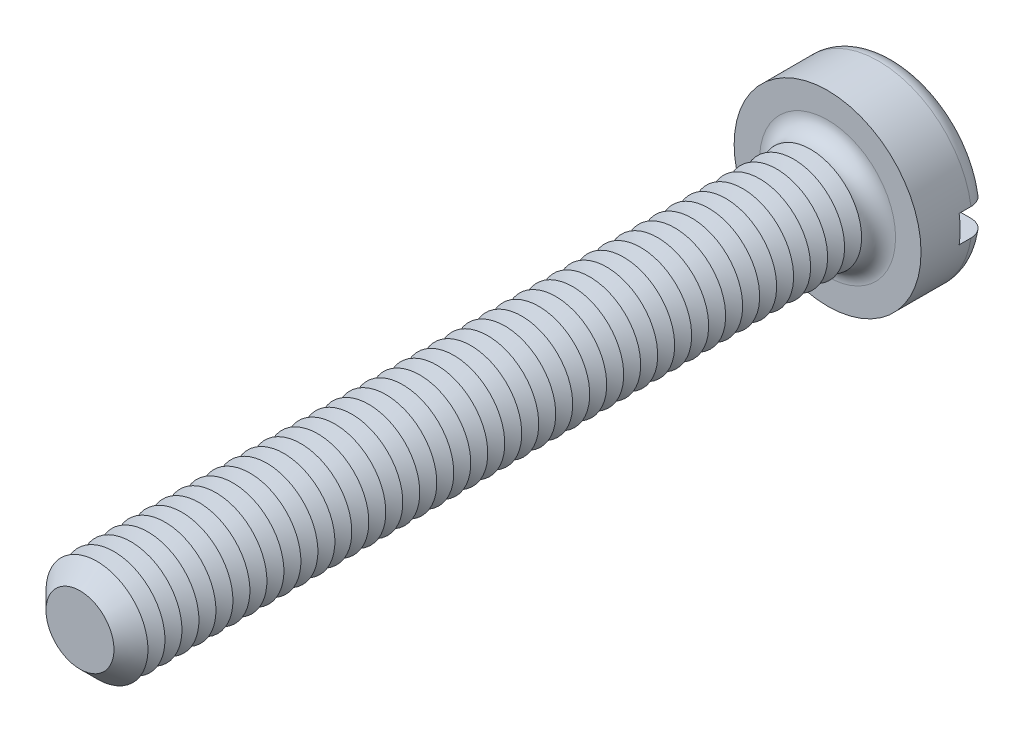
from build123d import *

# Parameters (mm, degrees)
SKETCH3_R           = 2.75
BOSS_EXTRUDE2_DEPTH = 2
SKETCH4_R           = 1.5
BOSS_EXTRUDE3_DEPTH = 22
FILLET1_R           = 0.5
CHAMFER1_SIZE       = 0.5
LPATTERN1_COUNT     = 42
LPATTERN1_PITCH     = 0.5
SKETCH8_W           = 5.5
SKETCH8_H           = 0.8
CUT_EXTRUDE1_DEPTH  = 0.85


with BuildPart() as part:
    # Sketch3 → Boss-Extrude2 (new body)
    with BuildSketch(Plane.XY):
        Circle(SKETCH3_R)
    extrude(amount=-BOSS_EXTRUDE2_DEPTH)

    # Sketch4 → Boss-Extrude3 (add)
    with BuildSketch(Plane.XY):
        Circle(SKETCH4_R)
    extrude(amount=BOSS_EXTRUDE3_DEPTH)

    # Fillet1
    fillet1_edges = [part.edges().sort_by_distance(p)[0] for p in [
        (-2.75, 0, -2),
        (-1.5, 0, 0),
    ]]
    fillet(fillet1_edges, radius=FILLET1_R)

    # Chamfer1
    chamfer1_edges = [part.edges().sort_by_distance(p)[0] for p in [
        (-1.5, 0, 22),
    ]]
    chamfer(chamfer1_edges, length=CHAMFER1_SIZE)

    # Sketch6 → Cut-Revolve1 (revolve, cut)
    with BuildSketch(Plane(origin=(0, 0, 0), x_dir=(0, 0, -1), z_dir=(1, 0, 0)), mode=Mode.PRIVATE) as cut_revolve1_sk:
        Polygon((-0.5, 1.5), (-0.75, 1.066987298), (-1, 1.5), align=None)
    cut_revolve1 = revolve(cut_revolve1_sk.sketch.rotate(Axis((0, 0, -1.694361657), (0, 0, 1)), 90), axis=Axis((0, 0, -1.694361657), (0, 0, 1)), mode=Mode.SUBTRACT)

    # LPattern1: Cut-Revolve1 ×42
    with Locations(*[(0, 0, i * LPATTERN1_PITCH) for i in range(1, LPATTERN1_COUNT)]):
        add(cut_revolve1, mode=Mode.SUBTRACT)

    # Sketch8 → Cut-Extrude1 (cut)
    with BuildSketch(Plane(origin=(0, 0, -2), x_dir=(-1, 0, 0), z_dir=(0, 0, -1))):
        Rectangle(SKETCH8_W, SKETCH8_H)
    extrude(amount=-CUT_EXTRUDE1_DEPTH, mode=Mode.SUBTRACT)


solid = part.part
